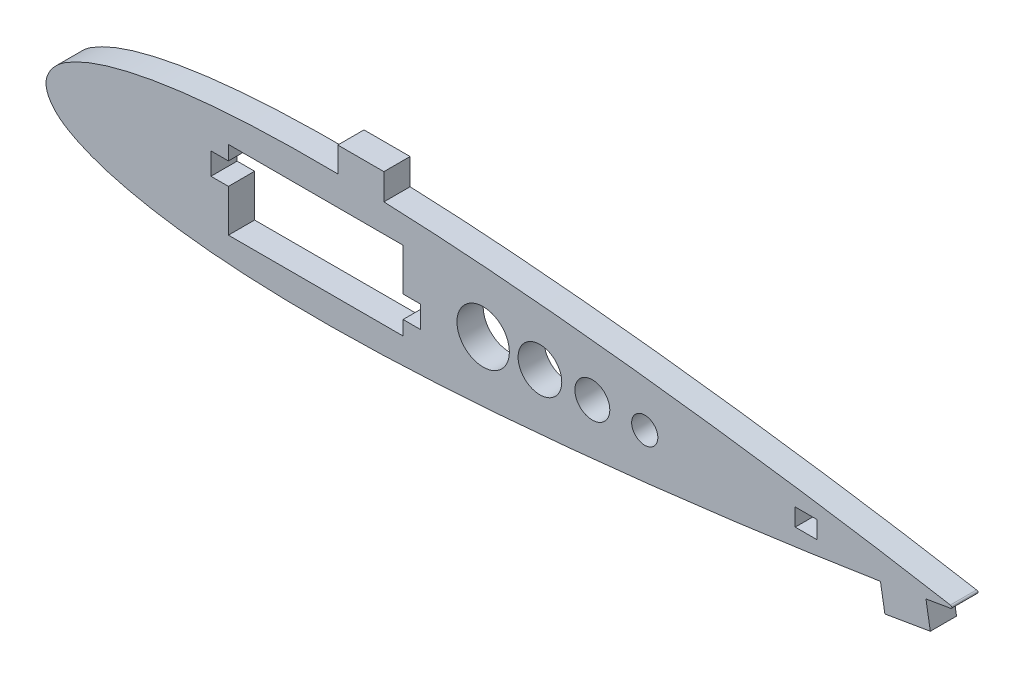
ISO-10303-21;
HEADER;
FILE_DESCRIPTION(('STEP AP214'),'2;1');
FILE_NAME('part.step','',(''),(''),'','','');
FILE_SCHEMA(('AUTOMOTIVE_DESIGN { 1 0 10303 214 1 1 1 1 }'));
ENDSEC;
DATA;
#1=APPLICATION_CONTEXT('core data for automotive mechanical design processes');
#2=APPLICATION_PROTOCOL_DEFINITION('international standard','automotive_design',2000,#1);
#3=PRODUCT_CONTEXT('',#1,'mechanical');
#4=PRODUCT('Part','Part','',(#3));
#5=PRODUCT_RELATED_PRODUCT_CATEGORY('part','',(#4));
#6=PRODUCT_DEFINITION_FORMATION('','',#4);
#7=PRODUCT_DEFINITION_CONTEXT('part definition',#1,'design');
#8=PRODUCT_DEFINITION('design','',#6,#7);
#9=PRODUCT_DEFINITION_SHAPE('','',#8);
#10=(LENGTH_UNIT() NAMED_UNIT(*) SI_UNIT(.MILLI.,.METRE.));
#11=(NAMED_UNIT(*) PLANE_ANGLE_UNIT() SI_UNIT($,.RADIAN.));
#12=(NAMED_UNIT(*) SI_UNIT($,.STERADIAN.) SOLID_ANGLE_UNIT());
#13=UNCERTAINTY_MEASURE_WITH_UNIT(LENGTH_MEASURE(1.E-05),#10,'distance_accuracy_value','');
#14=(GEOMETRIC_REPRESENTATION_CONTEXT(3) GLOBAL_UNCERTAINTY_ASSIGNED_CONTEXT((#13)) GLOBAL_UNIT_ASSIGNED_CONTEXT((#10,
#11,#12)) REPRESENTATION_CONTEXT('',''));
#15=CARTESIAN_POINT('',(0.,0.,0.));
#16=DIRECTION('',(0.,0.,1.));
#17=DIRECTION('',(1.,0.,0.));
#18=AXIS2_PLACEMENT_3D('',#15,#16,#17);
#19=CARTESIAN_POINT('',(100.000000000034,0.158000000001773,3.));
#20=CARTESIAN_POINT('',(98.2752033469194,0.45697951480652,3.));
#21=CARTESIAN_POINT('',(94.8282706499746,1.05447734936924,3.));
#22=CARTESIAN_POINT('',(87.930256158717,2.16588767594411,3.));
#23=CARTESIAN_POINT('',(79.30695073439,3.44267804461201,3.));
#24=CARTESIAN_POINT('',(68.9533281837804,4.80441995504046,3.));
#25=CARTESIAN_POINT('',(58.6004831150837,5.9873769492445,3.));
#26=CARTESIAN_POINT('',(48.2472554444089,6.95662593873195,3.));
#27=CARTESIAN_POINT('',(40.4253928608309,7.47959973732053,3.));
#28=CARTESIAN_POINT('',(36.056405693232,7.66684029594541,3.));
#29=CARTESIAN_POINT('',(35.1430318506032,7.70085583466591,3.));
#30=B_SPLINE_CURVE_WITH_KNOTS('',3,(#19,#20,#21,#22,#23,#24,#25,#26,#27,#28,#29),.UNSPECIFIED.,
.F.,.F.,(4,1,1,1,1,1,1,1,4),(0.,0.0246840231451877,0.0493299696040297,0.0985220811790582,
0.147602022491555,0.19657827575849,0.245450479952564,0.294218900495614,0.307105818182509),.UNSPECIFIED.);
#31=DIRECTION('',(0.,0.,-1.));
#32=VECTOR('',#31,1.);
#33=SURFACE_OF_LINEAR_EXTRUSION('',#30,#32);
#34=CARTESIAN_POINT('',(100.000000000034,0.158000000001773,0.));
#35=CARTESIAN_POINT('',(98.2752033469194,0.45697951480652,0.));
#36=CARTESIAN_POINT('',(94.8282706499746,1.05447734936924,0.));
#37=CARTESIAN_POINT('',(87.930256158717,2.16588767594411,0.));
#38=CARTESIAN_POINT('',(79.30695073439,3.44267804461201,0.));
#39=CARTESIAN_POINT('',(68.9533281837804,4.80441995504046,0.));
#40=CARTESIAN_POINT('',(58.6004831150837,5.9873769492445,0.));
#41=CARTESIAN_POINT('',(48.2472554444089,6.95662593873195,0.));
#42=CARTESIAN_POINT('',(40.4253928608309,7.47959973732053,0.));
#43=CARTESIAN_POINT('',(36.056405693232,7.66684029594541,0.));
#44=CARTESIAN_POINT('',(35.1430318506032,7.70085583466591,0.));
#45=B_SPLINE_CURVE_WITH_KNOTS('',3,(#34,#35,#36,#37,#38,#39,#40,#41,#42,#43,#44),.UNSPECIFIED.,
.F.,.F.,(4,1,1,1,1,1,1,1,4),(0.,0.0246840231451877,0.0493299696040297,0.0985220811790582,
0.147602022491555,0.19657827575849,0.245450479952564,0.294218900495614,0.307105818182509),.UNSPECIFIED.);
#46=CARTESIAN_POINT('',(100.000000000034,0.158000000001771,0.));
#47=VERTEX_POINT('',#46);
#48=CARTESIAN_POINT('',(35.1430318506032,7.70085583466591,0.));
#49=VERTEX_POINT('',#48);
#50=EDGE_CURVE('E333',#47,#49,#45,.T.);
#51=ORIENTED_EDGE('',*,*,#50,.T.);
#52=DIRECTION('',(0.,0.,-1.));
#53=VECTOR('',#52,1.);
#54=CARTESIAN_POINT('',(35.1430318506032,7.70085583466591,3.));
#55=LINE('',#54,#53);
#56=CARTESIAN_POINT('',(35.1430318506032,7.70085583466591,3.));
#57=VERTEX_POINT('',#56);
#58=EDGE_CURVE('E327',#57,#49,#55,.T.);
#59=ORIENTED_EDGE('',*,*,#58,.F.);
#60=CARTESIAN_POINT('',(100.000000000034,0.158000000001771,3.));
#61=VERTEX_POINT('',#60);
#62=EDGE_CURVE('E272',#61,#57,#30,.T.);
#63=ORIENTED_EDGE('',*,*,#62,.F.);
#64=DIRECTION('',(0.,0.,-1.));
#65=VECTOR('',#64,1.);
#66=CARTESIAN_POINT('',(100.000000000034,0.158000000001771,3.));
#67=LINE('',#66,#65);
#68=EDGE_CURVE('E368',#61,#47,#67,.T.);
#69=ORIENTED_EDGE('',*,*,#68,.T.);
#70=EDGE_LOOP('',(#51,#59,#63,#69));
#71=FACE_BOUND('',#70,.T.);
#72=ADVANCED_FACE('F40',(#71),#33,.F.);
#73=CARTESIAN_POINT('',(35.1430318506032,10.7008558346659,3.));
#74=DIRECTION('',(-1.,0.,0.));
#75=DIRECTION('',(0.,0.,1.));
#76=AXIS2_PLACEMENT_3D('',#73,#74,#75);
#77=PLANE('',#76);
#78=DIRECTION('',(0.,1.,0.));
#79=VECTOR('',#78,1.);
#80=CARTESIAN_POINT('',(35.1430318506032,10.7008558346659,0.));
#81=LINE('',#80,#79);
#82=CARTESIAN_POINT('',(35.1430318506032,10.7008558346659,0.));
#83=VERTEX_POINT('',#82);
#84=EDGE_CURVE('E322',#49,#83,#81,.T.);
#85=ORIENTED_EDGE('',*,*,#84,.T.);
#86=DIRECTION('',(0.,0.,-1.));
#87=VECTOR('',#86,1.);
#88=CARTESIAN_POINT('',(35.1430318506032,10.7008558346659,3.));
#89=LINE('',#88,#87);
#90=CARTESIAN_POINT('',(35.1430318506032,10.7008558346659,3.));
#91=VERTEX_POINT('',#90);
#92=EDGE_CURVE('E324',#91,#83,#89,.T.);
#93=ORIENTED_EDGE('',*,*,#92,.F.);
#94=DIRECTION('',(0.,1.,0.));
#95=VECTOR('',#94,1.);
#96=CARTESIAN_POINT('',(35.1430318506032,10.7008558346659,3.));
#97=LINE('',#96,#95);
#98=EDGE_CURVE('E278',#57,#91,#97,.T.);
#99=ORIENTED_EDGE('',*,*,#98,.F.);
#100=ORIENTED_EDGE('',*,*,#58,.T.);
#101=EDGE_LOOP('',(#85,#93,#99,#100));
#102=FACE_BOUND('',#101,.T.);
#103=ADVANCED_FACE('F312',(#102),#77,.F.);
#104=CARTESIAN_POINT('',(29.8630318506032,10.7008558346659,3.));
#105=DIRECTION('',(0.,-1.,0.));
#106=DIRECTION('',(0.,0.,-1.));
#107=AXIS2_PLACEMENT_3D('',#104,#105,#106);
#108=PLANE('',#107);
#109=DIRECTION('',(-1.,0.,0.));
#110=VECTOR('',#109,1.);
#111=CARTESIAN_POINT('',(29.8630318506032,10.7008558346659,0.));
#112=LINE('',#111,#110);
#113=CARTESIAN_POINT('',(29.8630318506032,10.7008558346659,0.));
#114=VERTEX_POINT('',#113);
#115=EDGE_CURVE('E332',#83,#114,#112,.T.);
#116=ORIENTED_EDGE('',*,*,#115,.T.);
#117=DIRECTION('',(0.,0.,-1.));
#118=VECTOR('',#117,1.);
#119=CARTESIAN_POINT('',(29.8630318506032,10.7008558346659,3.));
#120=LINE('',#119,#118);
#121=CARTESIAN_POINT('',(29.8630318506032,10.7008558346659,3.));
#122=VERTEX_POINT('',#121);
#123=EDGE_CURVE('E337',#122,#114,#120,.T.);
#124=ORIENTED_EDGE('',*,*,#123,.F.);
#125=DIRECTION('',(-1.,0.,0.));
#126=VECTOR('',#125,1.);
#127=CARTESIAN_POINT('',(29.8630318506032,10.7008558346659,3.));
#128=LINE('',#127,#126);
#129=EDGE_CURVE('E284',#91,#122,#128,.T.);
#130=ORIENTED_EDGE('',*,*,#129,.F.);
#131=ORIENTED_EDGE('',*,*,#92,.T.);
#132=EDGE_LOOP('',(#116,#124,#130,#131));
#133=FACE_BOUND('',#132,.T.);
#134=ADVANCED_FACE('F309',(#133),#108,.F.);
#135=CARTESIAN_POINT('',(29.8630318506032,10.7008558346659,3.));
#136=DIRECTION('',(1.,0.,0.));
#137=DIRECTION('',(0.,0.,-1.));
#138=AXIS2_PLACEMENT_3D('',#135,#136,#137);
#139=PLANE('',#138);
#140=DIRECTION('',(0.,-1.,0.));
#141=VECTOR('',#140,1.);
#142=CARTESIAN_POINT('',(29.8630318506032,10.7008558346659,0.));
#143=LINE('',#142,#141);
#144=CARTESIAN_POINT('',(29.8630318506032,7.83645408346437,0.));
#145=VERTEX_POINT('',#144);
#146=EDGE_CURVE('E342',#114,#145,#143,.T.);
#147=ORIENTED_EDGE('',*,*,#146,.T.);
#148=DIRECTION('',(0.,0.,-1.));
#149=VECTOR('',#148,1.);
#150=CARTESIAN_POINT('',(29.8630318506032,7.83645408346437,3.));
#151=LINE('',#150,#149);
#152=CARTESIAN_POINT('',(29.8630318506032,7.83645408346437,3.));
#153=VERTEX_POINT('',#152);
#154=EDGE_CURVE('E387',#153,#145,#151,.T.);
#155=ORIENTED_EDGE('',*,*,#154,.F.);
#156=DIRECTION('',(0.,-1.,0.));
#157=VECTOR('',#156,1.);
#158=CARTESIAN_POINT('',(29.8630318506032,10.7008558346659,3.));
#159=LINE('',#158,#157);
#160=EDGE_CURVE('E286',#122,#153,#159,.T.);
#161=ORIENTED_EDGE('',*,*,#160,.F.);
#162=ORIENTED_EDGE('',*,*,#123,.T.);
#163=EDGE_LOOP('',(#147,#155,#161,#162));
#164=FACE_BOUND('',#163,.T.);
#165=ADVANCED_FACE('F304',(#164),#139,.F.);
#166=CARTESIAN_POINT('',(29.8630318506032,7.83645408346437,3.));
#167=CARTESIAN_POINT('',(29.0848548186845,7.8468641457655,3.));
#168=CARTESIAN_POINT('',(26.5806343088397,7.86591663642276,3.));
#169=CARTESIAN_POINT('',(22.3481860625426,7.81355100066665,3.));
#170=CARTESIAN_POINT('',(17.164843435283,7.56395909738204,3.));
#171=CARTESIAN_POINT('',(11.9741002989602,7.07764275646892,3.));
#172=CARTESIAN_POINT('',(7.65230652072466,6.39306089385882,3.));
#173=CARTESIAN_POINT('',(4.20045051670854,5.57690727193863,3.));
#174=CARTESIAN_POINT('',(1.57930972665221,4.75740436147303,3.));
#175=CARTESIAN_POINT('',(-0.624643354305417,3.76154949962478,3.));
#176=CARTESIAN_POINT('',(-2.60356179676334,2.44260726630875,3.));
#177=CARTESIAN_POINT('',(-4.14030493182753,0.125949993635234,3.));
#178=CARTESIAN_POINT('',(-2.60941952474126,-2.19458232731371,3.));
#179=CARTESIAN_POINT('',(-0.633839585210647,-3.51851990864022,3.));
#180=CARTESIAN_POINT('',(1.56759052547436,-4.51993967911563,3.));
#181=CARTESIAN_POINT('',(4.18665255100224,-5.34606204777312,3.));
#182=CARTESIAN_POINT('',(7.63643560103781,-6.17093386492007,3.));
#183=CARTESIAN_POINT('',(11.9564860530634,-6.86643216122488,3.));
#184=CARTESIAN_POINT('',(17.1459839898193,-7.36586089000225,3.));
#185=CARTESIAN_POINT('',(22.3286795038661,-7.62854723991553,3.));
#186=CARTESIAN_POINT('',(29.235442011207,-7.73145319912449,3.));
#187=CARTESIAN_POINT('',(37.8728960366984,-7.50324815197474,3.));
#188=CARTESIAN_POINT('',(48.2298311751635,-6.83705655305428,3.));
#189=CARTESIAN_POINT('',(58.5854745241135,-5.89396714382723,3.));
#190=CARTESIAN_POINT('',(68.9412751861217,-4.73716944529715,3.));
#191=CARTESIAN_POINT('',(79.2983050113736,-3.40158936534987,3.));
#192=CARTESIAN_POINT('',(86.9807260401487,-2.2839360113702,3.));
#193=CARTESIAN_POINT('',(91.2118653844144,-1.62324988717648,3.));
#194=CARTESIAN_POINT('',(91.9959112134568,-1.49899002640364,3.));
#195=B_SPLINE_CURVE_WITH_KNOTS('',3,(#166,#167,#168,#169,#170,#171,#172,#173,#174,#175,#176,
#177,#178,#179,#180,#181,#182,#183,#184,#185,#186,#187,#188,#189,#190,#191,#192,#193,#194),
.UNSPECIFIED.,.F.,.F.,(4,1,1,1,1,1,1,1,1,1,1,1,1,1,1,1,1,1,1,1,1,1,1,1,1,1,4),
(0.331930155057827,0.342903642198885,0.367241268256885,0.391607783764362,0.416059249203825,
0.440726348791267,0.453242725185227,0.466028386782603,0.479472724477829,0.486972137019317,0.5,
0.513027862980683,0.520527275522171,0.533971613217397,0.546757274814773,0.559273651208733,
0.583940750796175,0.608392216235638,0.632758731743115,0.657096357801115,0.705781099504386,
0.754549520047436,0.803421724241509,0.852397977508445,0.901477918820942,0.95067003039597,
0.961863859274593),.UNSPECIFIED.);
#196=DIRECTION('',(0.,0.,-1.));
#197=VECTOR('',#196,1.);
#198=SURFACE_OF_LINEAR_EXTRUSION('',#195,#197);
#199=CARTESIAN_POINT('',(29.8630318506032,7.83645408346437,0.));
#200=CARTESIAN_POINT('',(29.0848548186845,7.8468641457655,0.));
#201=CARTESIAN_POINT('',(26.5806343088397,7.86591663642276,0.));
#202=CARTESIAN_POINT('',(22.3481860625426,7.81355100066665,0.));
#203=CARTESIAN_POINT('',(17.164843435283,7.56395909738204,0.));
#204=CARTESIAN_POINT('',(11.9741002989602,7.07764275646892,0.));
#205=CARTESIAN_POINT('',(7.65230652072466,6.39306089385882,0.));
#206=CARTESIAN_POINT('',(4.20045051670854,5.57690727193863,0.));
#207=CARTESIAN_POINT('',(1.57930972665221,4.75740436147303,0.));
#208=CARTESIAN_POINT('',(-0.624643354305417,3.76154949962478,0.));
#209=CARTESIAN_POINT('',(-2.60356179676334,2.44260726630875,0.));
#210=CARTESIAN_POINT('',(-4.14030493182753,0.125949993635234,0.));
#211=CARTESIAN_POINT('',(-2.60941952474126,-2.19458232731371,0.));
#212=CARTESIAN_POINT('',(-0.633839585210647,-3.51851990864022,0.));
#213=CARTESIAN_POINT('',(1.56759052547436,-4.51993967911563,0.));
#214=CARTESIAN_POINT('',(4.18665255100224,-5.34606204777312,0.));
#215=CARTESIAN_POINT('',(7.63643560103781,-6.17093386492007,0.));
#216=CARTESIAN_POINT('',(11.9564860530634,-6.86643216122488,0.));
#217=CARTESIAN_POINT('',(17.1459839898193,-7.36586089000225,0.));
#218=CARTESIAN_POINT('',(22.3286795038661,-7.62854723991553,0.));
#219=CARTESIAN_POINT('',(29.235442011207,-7.73145319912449,0.));
#220=CARTESIAN_POINT('',(37.8728960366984,-7.50324815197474,0.));
#221=CARTESIAN_POINT('',(48.2298311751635,-6.83705655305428,0.));
#222=CARTESIAN_POINT('',(58.5854745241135,-5.89396714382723,0.));
#223=CARTESIAN_POINT('',(68.9412751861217,-4.73716944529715,0.));
#224=CARTESIAN_POINT('',(79.2983050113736,-3.40158936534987,0.));
#225=CARTESIAN_POINT('',(86.9807260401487,-2.2839360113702,0.));
#226=CARTESIAN_POINT('',(91.2118653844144,-1.62324988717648,0.));
#227=CARTESIAN_POINT('',(91.9959112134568,-1.49899002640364,0.));
#228=B_SPLINE_CURVE_WITH_KNOTS('',3,(#199,#200,#201,#202,#203,#204,#205,#206,#207,#208,#209,
#210,#211,#212,#213,#214,#215,#216,#217,#218,#219,#220,#221,#222,#223,#224,#225,#226,#227),
.UNSPECIFIED.,.F.,.F.,(4,1,1,1,1,1,1,1,1,1,1,1,1,1,1,1,1,1,1,1,1,1,1,1,1,1,4),
(0.331930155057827,0.342903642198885,0.367241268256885,0.391607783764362,0.416059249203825,
0.440726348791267,0.453242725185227,0.466028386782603,0.479472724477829,0.486972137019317,0.5,
0.513027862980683,0.520527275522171,0.533971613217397,0.546757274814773,0.559273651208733,
0.583940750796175,0.608392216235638,0.632758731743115,0.657096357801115,0.705781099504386,
0.754549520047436,0.803421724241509,0.852397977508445,0.901477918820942,0.95067003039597,
0.961863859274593),.UNSPECIFIED.);
#229=CARTESIAN_POINT('',(91.9959112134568,-1.49899002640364,0.));
#230=VERTEX_POINT('',#229);
#231=EDGE_CURVE('E344',#145,#230,#228,.T.);
#232=ORIENTED_EDGE('',*,*,#231,.T.);
#233=DIRECTION('',(0.,0.,-1.));
#234=VECTOR('',#233,1.);
#235=CARTESIAN_POINT('',(91.9959112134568,-1.49899002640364,3.));
#236=LINE('',#235,#234);
#237=CARTESIAN_POINT('',(91.9959112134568,-1.49899002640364,3.));
#238=VERTEX_POINT('',#237);
#239=EDGE_CURVE('E384',#238,#230,#236,.T.);
#240=ORIENTED_EDGE('',*,*,#239,.F.);
#241=EDGE_CURVE('E288',#153,#238,#195,.T.);
#242=ORIENTED_EDGE('',*,*,#241,.F.);
#243=ORIENTED_EDGE('',*,*,#154,.T.);
#244=EDGE_LOOP('',(#232,#240,#242,#243));
#245=FACE_BOUND('',#244,.T.);
#246=ADVANCED_FACE('F299',(#245),#198,.F.);
#247=CARTESIAN_POINT('',(91.9959112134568,-1.49899002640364,3.));
#248=DIRECTION('',(0.985835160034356,0.167717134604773,0.));
#249=DIRECTION('',(-0.167717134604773,0.985835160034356,0.));
#250=AXIS2_PLACEMENT_3D('',#247,#248,#249);
#251=PLANE('',#250);
#252=DIRECTION('',(0.167717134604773,-0.985835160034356,0.));
#253=VECTOR('',#252,1.);
#254=CARTESIAN_POINT('',(91.9959112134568,-1.49899002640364,0.));
#255=LINE('',#254,#253);
#256=CARTESIAN_POINT('',(92.5030783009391,-4.48009954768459,0.));
#257=VERTEX_POINT('',#256);
#258=EDGE_CURVE('E351',#230,#257,#255,.T.);
#259=ORIENTED_EDGE('',*,*,#258,.T.);
#260=DIRECTION('',(0.,0.,-1.));
#261=VECTOR('',#260,1.);
#262=CARTESIAN_POINT('',(92.5030783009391,-4.48009954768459,3.));
#263=LINE('',#262,#261);
#264=CARTESIAN_POINT('',(92.5030783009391,-4.48009954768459,3.));
#265=VERTEX_POINT('',#264);
#266=EDGE_CURVE('E381',#265,#257,#263,.T.);
#267=ORIENTED_EDGE('',*,*,#266,.F.);
#268=DIRECTION('',(0.167717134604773,-0.985835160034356,0.));
#269=VECTOR('',#268,1.);
#270=CARTESIAN_POINT('',(91.9959112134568,-1.49899002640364,3.));
#271=LINE('',#270,#269);
#272=EDGE_CURVE('E293',#238,#265,#271,.T.);
#273=ORIENTED_EDGE('',*,*,#272,.F.);
#274=ORIENTED_EDGE('',*,*,#239,.T.);
#275=EDGE_LOOP('',(#259,#267,#273,#274));
#276=FACE_BOUND('',#275,.T.);
#277=ADVANCED_FACE('F303',(#276),#251,.F.);
#278=CARTESIAN_POINT('',(92.5030783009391,-4.48009954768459,3.));
#279=DIRECTION('',(-0.167717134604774,0.985835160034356,0.));
#280=DIRECTION('',(-0.985835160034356,-0.167717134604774,0.));
#281=AXIS2_PLACEMENT_3D('',#278,#279,#280);
#282=PLANE('',#281);
#283=DIRECTION('',(0.985835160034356,0.167717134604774,0.));
#284=VECTOR('',#283,1.);
#285=CARTESIAN_POINT('',(92.5030783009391,-4.48009954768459,0.));
#286=LINE('',#285,#284);
#287=CARTESIAN_POINT('',(97.7082879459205,-3.59455307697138,0.));
#288=VERTEX_POINT('',#287);
#289=EDGE_CURVE('E356',#257,#288,#286,.T.);
#290=ORIENTED_EDGE('',*,*,#289,.T.);
#291=DIRECTION('',(0.,0.,-1.));
#292=VECTOR('',#291,1.);
#293=CARTESIAN_POINT('',(97.7082879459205,-3.59455307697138,3.));
#294=LINE('',#293,#292);
#295=CARTESIAN_POINT('',(97.7082879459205,-3.59455307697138,3.));
#296=VERTEX_POINT('',#295);
#297=EDGE_CURVE('E378',#296,#288,#294,.T.);
#298=ORIENTED_EDGE('',*,*,#297,.F.);
#299=DIRECTION('',(0.985835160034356,0.167717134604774,0.));
#300=VECTOR('',#299,1.);
#301=CARTESIAN_POINT('',(92.5030783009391,-4.48009954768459,3.));
#302=LINE('',#301,#300);
#303=EDGE_CURVE('E575',#265,#296,#302,.T.);
#304=ORIENTED_EDGE('',*,*,#303,.F.);
#305=ORIENTED_EDGE('',*,*,#266,.T.);
#306=EDGE_LOOP('',(#290,#298,#304,#305));
#307=FACE_BOUND('',#306,.T.);
#308=ADVANCED_FACE('F572',(#307),#282,.F.);
#309=CARTESIAN_POINT('',(97.7082879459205,-3.59455307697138,3.));
#310=DIRECTION('',(-0.985835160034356,-0.167717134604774,0.));
#311=DIRECTION('',(0.167717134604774,-0.985835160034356,0.));
#312=AXIS2_PLACEMENT_3D('',#309,#310,#311);
#313=PLANE('',#312);
#314=DIRECTION('',(-0.167717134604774,0.985835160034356,0.));
#315=VECTOR('',#314,1.);
#316=CARTESIAN_POINT('',(97.7082879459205,-3.59455307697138,0.));
#317=LINE('',#316,#315);
#318=CARTESIAN_POINT('',(97.2051365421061,-0.637047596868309,0.));
#319=VERTEX_POINT('',#318);
#320=EDGE_CURVE('E358',#288,#319,#317,.T.);
#321=ORIENTED_EDGE('',*,*,#320,.T.);
#322=DIRECTION('',(0.,0.,-1.));
#323=VECTOR('',#322,1.);
#324=CARTESIAN_POINT('',(97.2051365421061,-0.637047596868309,3.));
#325=LINE('',#324,#323);
#326=CARTESIAN_POINT('',(97.2051365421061,-0.637047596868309,3.));
#327=VERTEX_POINT('',#326);
#328=EDGE_CURVE('E375',#327,#319,#325,.T.);
#329=ORIENTED_EDGE('',*,*,#328,.F.);
#330=DIRECTION('',(-0.167717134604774,0.985835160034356,0.));
#331=VECTOR('',#330,1.);
#332=CARTESIAN_POINT('',(97.7082879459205,-3.59455307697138,3.));
#333=LINE('',#332,#331);
#334=EDGE_CURVE('E548',#296,#327,#333,.T.);
#335=ORIENTED_EDGE('',*,*,#334,.F.);
#336=ORIENTED_EDGE('',*,*,#297,.T.);
#337=EDGE_LOOP('',(#321,#329,#335,#336));
#338=FACE_BOUND('',#337,.T.);
#339=ADVANCED_FACE('F540',(#338),#313,.F.);
#340=CARTESIAN_POINT('',(97.2051365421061,-0.637047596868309,3.));
#341=CARTESIAN_POINT('',(98.1369506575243,-0.478520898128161,3.));
#342=CARTESIAN_POINT('',(99.0684753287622,-0.318260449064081,3.));
#343=CARTESIAN_POINT('',(100.,-0.158,3.));
#344=B_SPLINE_CURVE_WITH_KNOTS('',3,(#340,#341,#342,#343),.UNSPECIFIED.,.F.,.F.,(4,4),
(0.986199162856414,1.),.UNSPECIFIED.);
#345=DIRECTION('',(0.,0.,-1.));
#346=VECTOR('',#345,1.);
#347=SURFACE_OF_LINEAR_EXTRUSION('',#344,#346);
#348=CARTESIAN_POINT('',(97.2051365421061,-0.637047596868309,0.));
#349=CARTESIAN_POINT('',(98.1369506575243,-0.478520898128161,0.));
#350=CARTESIAN_POINT('',(99.0684753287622,-0.318260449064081,0.));
#351=CARTESIAN_POINT('',(100.,-0.158,0.));
#352=B_SPLINE_CURVE_WITH_KNOTS('',3,(#348,#349,#350,#351),.UNSPECIFIED.,.F.,.F.,(4,4),
(0.986199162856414,1.),.UNSPECIFIED.);
#353=CARTESIAN_POINT('',(100.,-0.158000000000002,0.));
#354=VERTEX_POINT('',#353);
#355=EDGE_CURVE('E360',#319,#354,#352,.T.);
#356=ORIENTED_EDGE('',*,*,#355,.T.);
#357=DIRECTION('',(0.,0.,-1.));
#358=VECTOR('',#357,1.);
#359=CARTESIAN_POINT('',(100.,-0.158000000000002,3.));
#360=LINE('',#359,#358);
#361=CARTESIAN_POINT('',(100.,-0.158000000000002,3.));
#362=VERTEX_POINT('',#361);
#363=EDGE_CURVE('E371',#362,#354,#360,.T.);
#364=ORIENTED_EDGE('',*,*,#363,.F.);
#365=EDGE_CURVE('E542',#327,#362,#344,.T.);
#366=ORIENTED_EDGE('',*,*,#365,.F.);
#367=ORIENTED_EDGE('',*,*,#328,.T.);
#368=EDGE_LOOP('',(#356,#364,#366,#367));
#369=FACE_BOUND('',#368,.T.);
#370=ADVANCED_FACE('F535',(#369),#347,.F.);
#371=CARTESIAN_POINT('',(100.008153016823,0.,3.));
#372=DIRECTION('',(0.,0.,-1.));
#373=DIRECTION('',(-1.,0.,0.));
#374=AXIS2_PLACEMENT_3D('',#371,#372,#373);
#375=CYLINDRICAL_SURFACE('',#374,0.158210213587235);
#376=CARTESIAN_POINT('',(100.008153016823,0.,0.));
#377=DIRECTION('',(0.,0.,1.));
#378=DIRECTION('',(-1.,0.,0.));
#379=AXIS2_PLACEMENT_3D('',#376,#377,#378);
#380=CIRCLE('',#379,0.158210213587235);
#381=EDGE_CURVE('E279',#354,#47,#380,.T.);
#382=ORIENTED_EDGE('',*,*,#381,.T.);
#383=ORIENTED_EDGE('',*,*,#68,.F.);
#384=CARTESIAN_POINT('',(100.008153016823,0.,3.));
#385=DIRECTION('',(0.,0.,1.));
#386=DIRECTION('',(-1.,0.,0.));
#387=AXIS2_PLACEMENT_3D('',#384,#385,#386);
#388=CIRCLE('',#387,0.158210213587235);
#389=EDGE_CURVE('E372',#362,#61,#388,.T.);
#390=ORIENTED_EDGE('',*,*,#389,.F.);
#391=ORIENTED_EDGE('',*,*,#363,.T.);
#392=EDGE_LOOP('',(#382,#383,#390,#391));
#393=FACE_BOUND('',#392,.T.);
#394=ADVANCED_FACE('F452',(#393),#375,.T.);
#395=CARTESIAN_POINT('',(67.6856329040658,4.92908077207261,3.));
#396=DIRECTION('',(0.,0.,-1.));
#397=DIRECTION('',(-1.,0.,0.));
#398=AXIS2_PLACEMENT_3D('',#395,#396,#397);
#399=PLANE('',#398);
#400=DIRECTION('',(1.,0.,0.));
#401=VECTOR('',#400,1.);
#402=CARTESIAN_POINT('',(82.2396965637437,-1.,3.));
#403=LINE('',#402,#401);
#404=CARTESIAN_POINT('',(82.2396965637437,-1.,3.));
#405=VERTEX_POINT('',#404);
#406=CARTESIAN_POINT('',(84.7596965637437,-1.,3.));
#407=VERTEX_POINT('',#406);
#408=EDGE_CURVE('E266',#405,#407,#403,.T.);
#409=ORIENTED_EDGE('',*,*,#408,.F.);
#410=DIRECTION('',(0.,-1.,0.));
#411=VECTOR('',#410,1.);
#412=CARTESIAN_POINT('',(82.2396965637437,1.,3.));
#413=LINE('',#412,#411);
#414=CARTESIAN_POINT('',(82.2396965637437,1.,3.));
#415=VERTEX_POINT('',#414);
#416=EDGE_CURVE('E55',#415,#405,#413,.T.);
#417=ORIENTED_EDGE('',*,*,#416,.F.);
#418=DIRECTION('',(-1.,0.,0.));
#419=VECTOR('',#418,1.);
#420=CARTESIAN_POINT('',(82.2396965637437,1.,3.));
#421=LINE('',#420,#419);
#422=CARTESIAN_POINT('',(84.7596965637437,1.,3.));
#423=VERTEX_POINT('',#422);
#424=EDGE_CURVE('E254',#423,#415,#421,.T.);
#425=ORIENTED_EDGE('',*,*,#424,.F.);
#426=DIRECTION('',(0.,1.,0.));
#427=VECTOR('',#426,1.);
#428=CARTESIAN_POINT('',(84.7596965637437,1.,3.));
#429=LINE('',#428,#427);
#430=EDGE_CURVE('E263',#407,#423,#429,.T.);
#431=ORIENTED_EDGE('',*,*,#430,.F.);
#432=EDGE_LOOP('',(#409,#417,#425,#431));
#433=FACE_BOUND('',#432,.T.);
#434=CARTESIAN_POINT('',(53.0081530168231,0.,3.));
#435=DIRECTION('',(0.,0.,1.));
#436=DIRECTION('',(1.,0.,0.));
#437=AXIS2_PLACEMENT_3D('',#434,#435,#436);
#438=CIRCLE('',#437,2.5);
#439=CARTESIAN_POINT('',(55.5081530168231,0.,3.));
#440=VERTEX_POINT('',#439);
#441=EDGE_CURVE('E246',#440,#440,#438,.T.);
#442=ORIENTED_EDGE('',*,*,#441,.F.);
#443=EDGE_LOOP('',(#442));
#444=FACE_BOUND('',#443,.T.);
#445=CARTESIAN_POINT('',(59.0081530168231,0.,3.));
#446=DIRECTION('',(0.,0.,1.));
#447=DIRECTION('',(1.,0.,0.));
#448=AXIS2_PLACEMENT_3D('',#445,#446,#447);
#449=CIRCLE('',#448,2.);
#450=CARTESIAN_POINT('',(61.0081530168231,0.,3.));
#451=VERTEX_POINT('',#450);
#452=EDGE_CURVE('E240',#451,#451,#449,.T.);
#453=ORIENTED_EDGE('',*,*,#452,.F.);
#454=EDGE_LOOP('',(#453));
#455=FACE_BOUND('',#454,.T.);
#456=CARTESIAN_POINT('',(65.0081530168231,0.,3.));
#457=DIRECTION('',(0.,0.,1.));
#458=DIRECTION('',(1.,0.,0.));
#459=AXIS2_PLACEMENT_3D('',#456,#457,#458);
#460=CIRCLE('',#459,1.5);
#461=CARTESIAN_POINT('',(66.5081530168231,0.,3.));
#462=VERTEX_POINT('',#461);
#463=EDGE_CURVE('E237',#462,#462,#460,.T.);
#464=ORIENTED_EDGE('',*,*,#463,.F.);
#465=EDGE_LOOP('',(#464));
#466=FACE_BOUND('',#465,.T.);
#467=DIRECTION('',(-1.,0.,0.));
#468=VECTOR('',#467,1.);
#469=CARTESIAN_POINT('',(15.3414863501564,2.86,3.));
#470=LINE('',#469,#468);
#471=CARTESIAN_POINT('',(17.3414863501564,2.86,3.));
#472=VERTEX_POINT('',#471);
#473=CARTESIAN_POINT('',(15.3414863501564,2.86,3.));
#474=VERTEX_POINT('',#473);
#475=EDGE_CURVE('E236',#472,#474,#470,.T.);
#476=ORIENTED_EDGE('',*,*,#475,.F.);
#477=DIRECTION('',(0.,-1.,0.));
#478=VECTOR('',#477,1.);
#479=CARTESIAN_POINT('',(17.3414863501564,4.5,3.));
#480=LINE('',#479,#478);
#481=CARTESIAN_POINT('',(17.3414863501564,4.5,3.));
#482=VERTEX_POINT('',#481);
#483=EDGE_CURVE('E63',#482,#472,#480,.T.);
#484=ORIENTED_EDGE('',*,*,#483,.F.);
#485=DIRECTION('',(-1.,0.,0.));
#486=VECTOR('',#485,1.);
#487=CARTESIAN_POINT('',(17.3414863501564,4.5,3.));
#488=LINE('',#487,#486);
#489=CARTESIAN_POINT('',(37.3414863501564,4.5,3.));
#490=VERTEX_POINT('',#489);
#491=EDGE_CURVE('E222',#490,#482,#488,.T.);
#492=ORIENTED_EDGE('',*,*,#491,.F.);
#493=DIRECTION('',(0.,1.,0.));
#494=VECTOR('',#493,1.);
#495=CARTESIAN_POINT('',(37.3414863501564,4.5,3.));
#496=LINE('',#495,#494);
#497=CARTESIAN_POINT('',(37.3414863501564,-0.34,3.));
#498=VERTEX_POINT('',#497);
#499=EDGE_CURVE('E228',#498,#490,#496,.T.);
#500=ORIENTED_EDGE('',*,*,#499,.F.);
#501=DIRECTION('',(-1.,0.,0.));
#502=VECTOR('',#501,1.);
#503=CARTESIAN_POINT('',(37.3414863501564,-0.34,3.));
#504=LINE('',#503,#502);
#505=CARTESIAN_POINT('',(39.3414863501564,-0.34,3.));
#506=VERTEX_POINT('',#505);
#507=EDGE_CURVE('E861',#506,#498,#504,.T.);
#508=ORIENTED_EDGE('',*,*,#507,.F.);
#509=DIRECTION('',(0.,1.,0.));
#510=VECTOR('',#509,1.);
#511=CARTESIAN_POINT('',(39.3414863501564,-0.34,3.));
#512=LINE('',#511,#510);
#513=CARTESIAN_POINT('',(39.3414863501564,-2.86,3.));
#514=VERTEX_POINT('',#513);
#515=EDGE_CURVE('E864',#514,#506,#512,.T.);
#516=ORIENTED_EDGE('',*,*,#515,.F.);
#517=DIRECTION('',(1.,0.,0.));
#518=VECTOR('',#517,1.);
#519=CARTESIAN_POINT('',(37.3414863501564,-2.86,3.));
#520=LINE('',#519,#518);
#521=CARTESIAN_POINT('',(37.3414863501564,-2.86,3.));
#522=VERTEX_POINT('',#521);
#523=EDGE_CURVE('E867',#522,#514,#520,.T.);
#524=ORIENTED_EDGE('',*,*,#523,.F.);
#525=DIRECTION('',(0.,1.,0.));
#526=VECTOR('',#525,1.);
#527=CARTESIAN_POINT('',(37.3414863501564,-2.86,3.));
#528=LINE('',#527,#526);
#529=CARTESIAN_POINT('',(37.3414863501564,-4.5,3.));
#530=VERTEX_POINT('',#529);
#531=EDGE_CURVE('E870',#530,#522,#528,.T.);
#532=ORIENTED_EDGE('',*,*,#531,.F.);
#533=DIRECTION('',(1.,0.,0.));
#534=VECTOR('',#533,1.);
#535=CARTESIAN_POINT('',(17.3414863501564,-4.5,3.));
#536=LINE('',#535,#534);
#537=CARTESIAN_POINT('',(17.3414863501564,-4.5,3.));
#538=VERTEX_POINT('',#537);
#539=EDGE_CURVE('E873',#538,#530,#536,.T.);
#540=ORIENTED_EDGE('',*,*,#539,.F.);
#541=DIRECTION('',(0.,-1.,0.));
#542=VECTOR('',#541,1.);
#543=CARTESIAN_POINT('',(17.3414863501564,0.34,3.));
#544=LINE('',#543,#542);
#545=CARTESIAN_POINT('',(17.3414863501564,0.34,3.));
#546=VERTEX_POINT('',#545);
#547=EDGE_CURVE('E876',#546,#538,#544,.T.);
#548=ORIENTED_EDGE('',*,*,#547,.F.);
#549=DIRECTION('',(1.,0.,0.));
#550=VECTOR('',#549,1.);
#551=CARTESIAN_POINT('',(15.3414863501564,0.34,3.));
#552=LINE('',#551,#550);
#553=CARTESIAN_POINT('',(15.3414863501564,0.34,3.));
#554=VERTEX_POINT('',#553);
#555=EDGE_CURVE('E879',#554,#546,#552,.T.);
#556=ORIENTED_EDGE('',*,*,#555,.F.);
#557=DIRECTION('',(0.,-1.,0.));
#558=VECTOR('',#557,1.);
#559=CARTESIAN_POINT('',(15.3414863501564,2.86,3.));
#560=LINE('',#559,#558);
#561=EDGE_CURVE('E242',#474,#554,#560,.T.);
#562=ORIENTED_EDGE('',*,*,#561,.F.);
#563=EDGE_LOOP('',(#476,#484,#492,#500,#508,#516,#524,#532,#540,#548,#556,#562));
#564=FACE_BOUND('',#563,.T.);
#565=CARTESIAN_POINT('',(46.5081530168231,0.,3.));
#566=DIRECTION('',(0.,0.,1.));
#567=DIRECTION('',(1.,0.,0.));
#568=AXIS2_PLACEMENT_3D('',#565,#566,#567);
#569=CIRCLE('',#568,3.);
#570=CARTESIAN_POINT('',(49.5081530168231,0.,3.));
#571=VERTEX_POINT('',#570);
#572=EDGE_CURVE('E249',#571,#571,#569,.T.);
#573=ORIENTED_EDGE('',*,*,#572,.F.);
#574=EDGE_LOOP('',(#573));
#575=FACE_BOUND('',#574,.T.);
#576=ORIENTED_EDGE('',*,*,#62,.T.);
#577=ORIENTED_EDGE('',*,*,#98,.T.);
#578=ORIENTED_EDGE('',*,*,#129,.T.);
#579=ORIENTED_EDGE('',*,*,#160,.T.);
#580=ORIENTED_EDGE('',*,*,#241,.T.);
#581=ORIENTED_EDGE('',*,*,#272,.T.);
#582=ORIENTED_EDGE('',*,*,#303,.T.);
#583=ORIENTED_EDGE('',*,*,#334,.T.);
#584=ORIENTED_EDGE('',*,*,#365,.T.);
#585=ORIENTED_EDGE('',*,*,#389,.T.);
#586=EDGE_LOOP('',(#576,#577,#578,#579,#580,#581,#582,#583,#584,#585));
#587=FACE_BOUND('',#586,.T.);
#588=ADVANCED_FACE('F232',(#433,#444,#455,#466,#564,#575,#587),#399,.F.);
#589=CARTESIAN_POINT('',(67.6856329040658,4.92908077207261,0.));
#590=DIRECTION('',(0.,0.,-1.));
#591=DIRECTION('',(-1.,0.,0.));
#592=AXIS2_PLACEMENT_3D('',#589,#590,#591);
#593=PLANE('',#592);
#594=DIRECTION('',(0.,1.,0.));
#595=VECTOR('',#594,1.);
#596=CARTESIAN_POINT('',(82.2396965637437,4.92908077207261,0.));
#597=LINE('',#596,#595);
#598=CARTESIAN_POINT('',(82.2396965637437,-1.,0.));
#599=VERTEX_POINT('',#598);
#600=CARTESIAN_POINT('',(82.2396965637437,1.,0.));
#601=VERTEX_POINT('',#600);
#602=EDGE_CURVE('E11',#599,#601,#597,.T.);
#603=ORIENTED_EDGE('',*,*,#602,.F.);
#604=DIRECTION('',(-1.,0.,0.));
#605=VECTOR('',#604,1.);
#606=CARTESIAN_POINT('',(67.6856329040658,-1.,0.));
#607=LINE('',#606,#605);
#608=CARTESIAN_POINT('',(84.7596965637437,-0.999999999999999,0.));
#609=VERTEX_POINT('',#608);
#610=EDGE_CURVE('E419',#609,#599,#607,.T.);
#611=ORIENTED_EDGE('',*,*,#610,.F.);
#612=DIRECTION('',(0.,-1.,0.));
#613=VECTOR('',#612,1.);
#614=CARTESIAN_POINT('',(84.7596965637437,4.92908077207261,0.));
#615=LINE('',#614,#613);
#616=CARTESIAN_POINT('',(84.7596965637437,1.,0.));
#617=VERTEX_POINT('',#616);
#618=EDGE_CURVE('E429',#617,#609,#615,.T.);
#619=ORIENTED_EDGE('',*,*,#618,.F.);
#620=DIRECTION('',(1.,0.,0.));
#621=VECTOR('',#620,1.);
#622=CARTESIAN_POINT('',(67.6856329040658,0.999999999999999,0.));
#623=LINE('',#622,#621);
#624=EDGE_CURVE('E48',#601,#617,#623,.T.);
#625=ORIENTED_EDGE('',*,*,#624,.F.);
#626=EDGE_LOOP('',(#603,#611,#619,#625));
#627=FACE_BOUND('',#626,.T.);
#628=CARTESIAN_POINT('',(53.0081530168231,0.,0.));
#629=DIRECTION('',(0.,0.,-1.));
#630=DIRECTION('',(-1.,0.,0.));
#631=AXIS2_PLACEMENT_3D('',#628,#629,#630);
#632=CIRCLE('',#631,2.5);
#633=CARTESIAN_POINT('',(50.5081530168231,0.,0.));
#634=VERTEX_POINT('',#633);
#635=EDGE_CURVE('E425',#634,#634,#632,.T.);
#636=ORIENTED_EDGE('',*,*,#635,.F.);
#637=EDGE_LOOP('',(#636));
#638=FACE_BOUND('',#637,.T.);
#639=CARTESIAN_POINT('',(59.0081530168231,0.,0.));
#640=DIRECTION('',(0.,0.,-1.));
#641=DIRECTION('',(-1.,0.,0.));
#642=AXIS2_PLACEMENT_3D('',#639,#640,#641);
#643=CIRCLE('',#642,2.);
#644=CARTESIAN_POINT('',(57.0081530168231,0.,0.));
#645=VERTEX_POINT('',#644);
#646=EDGE_CURVE('E422',#645,#645,#643,.T.);
#647=ORIENTED_EDGE('',*,*,#646,.F.);
#648=EDGE_LOOP('',(#647));
#649=FACE_BOUND('',#648,.T.);
#650=CARTESIAN_POINT('',(65.0081530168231,0.,0.));
#651=DIRECTION('',(0.,0.,-1.));
#652=DIRECTION('',(-1.,0.,0.));
#653=AXIS2_PLACEMENT_3D('',#650,#651,#652);
#654=CIRCLE('',#653,1.5);
#655=CARTESIAN_POINT('',(63.5081530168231,0.,0.));
#656=VERTEX_POINT('',#655);
#657=EDGE_CURVE('E395',#656,#656,#654,.T.);
#658=ORIENTED_EDGE('',*,*,#657,.F.);
#659=EDGE_LOOP('',(#658));
#660=FACE_BOUND('',#659,.T.);
#661=DIRECTION('',(0.,1.,0.));
#662=VECTOR('',#661,1.);
#663=CARTESIAN_POINT('',(17.3414863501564,4.92908077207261,0.));
#664=LINE('',#663,#662);
#665=CARTESIAN_POINT('',(17.3414863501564,2.86,0.));
#666=VERTEX_POINT('',#665);
#667=CARTESIAN_POINT('',(17.3414863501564,4.5,0.));
#668=VERTEX_POINT('',#667);
#669=EDGE_CURVE('E216',#666,#668,#664,.T.);
#670=ORIENTED_EDGE('',*,*,#669,.F.);
#671=DIRECTION('',(1.,0.,0.));
#672=VECTOR('',#671,1.);
#673=CARTESIAN_POINT('',(67.6856329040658,2.86,0.));
#674=LINE('',#673,#672);
#675=CARTESIAN_POINT('',(15.3414863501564,2.86,0.));
#676=VERTEX_POINT('',#675);
#677=EDGE_CURVE('E392',#676,#666,#674,.T.);
#678=ORIENTED_EDGE('',*,*,#677,.F.);
#679=DIRECTION('',(0.,1.,0.));
#680=VECTOR('',#679,1.);
#681=CARTESIAN_POINT('',(15.3414863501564,4.92908077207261,0.));
#682=LINE('',#681,#680);
#683=CARTESIAN_POINT('',(15.3414863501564,0.34,0.));
#684=VERTEX_POINT('',#683);
#685=EDGE_CURVE('E397',#684,#676,#682,.T.);
#686=ORIENTED_EDGE('',*,*,#685,.F.);
#687=DIRECTION('',(-1.,0.,0.));
#688=VECTOR('',#687,1.);
#689=CARTESIAN_POINT('',(67.6856329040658,0.34,0.));
#690=LINE('',#689,#688);
#691=CARTESIAN_POINT('',(17.3414863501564,0.34,0.));
#692=VERTEX_POINT('',#691);
#693=EDGE_CURVE('E400',#692,#684,#690,.T.);
#694=ORIENTED_EDGE('',*,*,#693,.F.);
#695=DIRECTION('',(0.,1.,0.));
#696=VECTOR('',#695,1.);
#697=CARTESIAN_POINT('',(17.3414863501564,4.92908077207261,0.));
#698=LINE('',#697,#696);
#699=CARTESIAN_POINT('',(17.3414863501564,-4.5,0.));
#700=VERTEX_POINT('',#699);
#701=EDGE_CURVE('E402',#700,#692,#698,.T.);
#702=ORIENTED_EDGE('',*,*,#701,.F.);
#703=DIRECTION('',(-1.,0.,0.));
#704=VECTOR('',#703,1.);
#705=CARTESIAN_POINT('',(67.6856329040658,-4.49999999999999,0.));
#706=LINE('',#705,#704);
#707=CARTESIAN_POINT('',(37.3414863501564,-4.5,0.));
#708=VERTEX_POINT('',#707);
#709=EDGE_CURVE('E404',#708,#700,#706,.T.);
#710=ORIENTED_EDGE('',*,*,#709,.F.);
#711=DIRECTION('',(0.,-1.,0.));
#712=VECTOR('',#711,1.);
#713=CARTESIAN_POINT('',(37.3414863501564,4.92908077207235,0.));
#714=LINE('',#713,#712);
#715=CARTESIAN_POINT('',(37.3414863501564,-2.86,0.));
#716=VERTEX_POINT('',#715);
#717=EDGE_CURVE('E406',#716,#708,#714,.T.);
#718=ORIENTED_EDGE('',*,*,#717,.F.);
#719=DIRECTION('',(-1.,0.,0.));
#720=VECTOR('',#719,1.);
#721=CARTESIAN_POINT('',(67.6856329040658,-2.86,0.));
#722=LINE('',#721,#720);
#723=CARTESIAN_POINT('',(39.3414863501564,-2.86,0.));
#724=VERTEX_POINT('',#723);
#725=EDGE_CURVE('E408',#724,#716,#722,.T.);
#726=ORIENTED_EDGE('',*,*,#725,.F.);
#727=DIRECTION('',(0.,-1.,0.));
#728=VECTOR('',#727,1.);
#729=CARTESIAN_POINT('',(39.3414863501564,4.92908077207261,0.));
#730=LINE('',#729,#728);
#731=CARTESIAN_POINT('',(39.3414863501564,-0.34,0.));
#732=VERTEX_POINT('',#731);
#733=EDGE_CURVE('E410',#732,#724,#730,.T.);
#734=ORIENTED_EDGE('',*,*,#733,.F.);
#735=DIRECTION('',(1.,0.,0.));
#736=VECTOR('',#735,1.);
#737=CARTESIAN_POINT('',(67.6856329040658,-0.34,0.));
#738=LINE('',#737,#736);
#739=CARTESIAN_POINT('',(37.3414863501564,-0.34,0.));
#740=VERTEX_POINT('',#739);
#741=EDGE_CURVE('E412',#740,#732,#738,.T.);
#742=ORIENTED_EDGE('',*,*,#741,.F.);
#743=DIRECTION('',(0.,-1.,0.));
#744=VECTOR('',#743,1.);
#745=CARTESIAN_POINT('',(37.3414863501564,4.92908077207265,0.));
#746=LINE('',#745,#744);
#747=CARTESIAN_POINT('',(37.3414863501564,4.5,0.));
#748=VERTEX_POINT('',#747);
#749=EDGE_CURVE('E414',#748,#740,#746,.T.);
#750=ORIENTED_EDGE('',*,*,#749,.F.);
#751=DIRECTION('',(1.,0.,0.));
#752=VECTOR('',#751,1.);
#753=CARTESIAN_POINT('',(67.6856329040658,4.50000000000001,0.));
#754=LINE('',#753,#752);
#755=EDGE_CURVE('E416',#668,#748,#754,.T.);
#756=ORIENTED_EDGE('',*,*,#755,.F.);
#757=EDGE_LOOP('',(#670,#678,#686,#694,#702,#710,#718,#726,#734,#742,#750,#756));
#758=FACE_BOUND('',#757,.T.);
#759=CARTESIAN_POINT('',(46.5081530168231,0.,0.));
#760=DIRECTION('',(0.,0.,-1.));
#761=DIRECTION('',(-1.,0.,0.));
#762=AXIS2_PLACEMENT_3D('',#759,#760,#761);
#763=CIRCLE('',#762,3.);
#764=CARTESIAN_POINT('',(43.5081530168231,0.,0.));
#765=VERTEX_POINT('',#764);
#766=EDGE_CURVE('E271',#765,#765,#763,.T.);
#767=ORIENTED_EDGE('',*,*,#766,.F.);
#768=EDGE_LOOP('',(#767));
#769=FACE_BOUND('',#768,.T.);
#770=ORIENTED_EDGE('',*,*,#50,.F.);
#771=ORIENTED_EDGE('',*,*,#381,.F.);
#772=ORIENTED_EDGE('',*,*,#355,.F.);
#773=ORIENTED_EDGE('',*,*,#320,.F.);
#774=ORIENTED_EDGE('',*,*,#289,.F.);
#775=ORIENTED_EDGE('',*,*,#258,.F.);
#776=ORIENTED_EDGE('',*,*,#231,.F.);
#777=ORIENTED_EDGE('',*,*,#146,.F.);
#778=ORIENTED_EDGE('',*,*,#115,.F.);
#779=ORIENTED_EDGE('',*,*,#84,.F.);
#780=EDGE_LOOP('',(#770,#771,#772,#773,#774,#775,#776,#777,#778,#779));
#781=FACE_BOUND('',#780,.T.);
#782=ADVANCED_FACE('F340',(#627,#638,#649,#660,#758,#769,#781),#593,.T.);
#783=CARTESIAN_POINT('',(46.5081530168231,0.,-7.));
#784=DIRECTION('',(0.,0.,1.));
#785=DIRECTION('',(1.,0.,0.));
#786=AXIS2_PLACEMENT_3D('',#783,#784,#785);
#787=CYLINDRICAL_SURFACE('',#786,3.);
#788=ORIENTED_EDGE('',*,*,#766,.T.);
#789=EDGE_LOOP('',(#788));
#790=FACE_BOUND('',#789,.T.);
#791=ORIENTED_EDGE('',*,*,#572,.T.);
#792=EDGE_LOOP('',(#791));
#793=FACE_BOUND('',#792,.T.);
#794=ADVANCED_FACE('F478',(#790,#793),#787,.F.);
#795=CARTESIAN_POINT('',(17.3414863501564,4.5,-7.));
#796=DIRECTION('',(-1.,0.,0.));
#797=DIRECTION('',(0.,0.,1.));
#798=AXIS2_PLACEMENT_3D('',#795,#796,#797);
#799=PLANE('',#798);
#800=ORIENTED_EDGE('',*,*,#669,.T.);
#801=DIRECTION('',(0.,0.,1.));
#802=VECTOR('',#801,1.);
#803=CARTESIAN_POINT('',(17.3414863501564,4.5,-7.));
#804=LINE('',#803,#802);
#805=EDGE_CURVE('E212',#668,#482,#804,.T.);
#806=ORIENTED_EDGE('',*,*,#805,.T.);
#807=ORIENTED_EDGE('',*,*,#483,.T.);
#808=DIRECTION('',(0.,0.,1.));
#809=VECTOR('',#808,1.);
#810=CARTESIAN_POINT('',(17.3414863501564,2.86,-7.));
#811=LINE('',#810,#809);
#812=EDGE_CURVE('E229',#666,#472,#811,.T.);
#813=ORIENTED_EDGE('',*,*,#812,.F.);
#814=EDGE_LOOP('',(#800,#806,#807,#813));
#815=FACE_BOUND('',#814,.T.);
#816=ADVANCED_FACE('F214',(#815),#799,.F.);
#817=CARTESIAN_POINT('',(17.3414863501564,4.5,-7.));
#818=DIRECTION('',(0.,1.,0.));
#819=DIRECTION('',(-1.,0.,0.));
#820=AXIS2_PLACEMENT_3D('',#817,#818,#819);
#821=PLANE('',#820);
#822=ORIENTED_EDGE('',*,*,#755,.T.);
#823=DIRECTION('',(0.,0.,1.));
#824=VECTOR('',#823,1.);
#825=CARTESIAN_POINT('',(37.3414863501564,4.5,-7.));
#826=LINE('',#825,#824);
#827=EDGE_CURVE('E219',#748,#490,#826,.T.);
#828=ORIENTED_EDGE('',*,*,#827,.T.);
#829=ORIENTED_EDGE('',*,*,#491,.T.);
#830=ORIENTED_EDGE('',*,*,#805,.F.);
#831=EDGE_LOOP('',(#822,#828,#829,#830));
#832=FACE_BOUND('',#831,.T.);
#833=ADVANCED_FACE('F223',(#832),#821,.F.);
#834=CARTESIAN_POINT('',(37.3414863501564,4.5,-7.));
#835=DIRECTION('',(1.,0.,0.));
#836=DIRECTION('',(0.,1.,0.));
#837=AXIS2_PLACEMENT_3D('',#834,#835,#836);
#838=PLANE('',#837);
#839=ORIENTED_EDGE('',*,*,#749,.T.);
#840=DIRECTION('',(0.,0.,1.));
#841=VECTOR('',#840,1.);
#842=CARTESIAN_POINT('',(37.3414863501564,-0.34,-7.));
#843=LINE('',#842,#841);
#844=EDGE_CURVE('E854',#740,#498,#843,.T.);
#845=ORIENTED_EDGE('',*,*,#844,.T.);
#846=ORIENTED_EDGE('',*,*,#499,.T.);
#847=ORIENTED_EDGE('',*,*,#827,.F.);
#848=EDGE_LOOP('',(#839,#845,#846,#847));
#849=FACE_BOUND('',#848,.T.);
#850=ADVANCED_FACE('F510',(#849),#838,.F.);
#851=CARTESIAN_POINT('',(37.3414863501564,-0.34,-7.));
#852=DIRECTION('',(0.,1.,0.));
#853=DIRECTION('',(0.,0.,1.));
#854=AXIS2_PLACEMENT_3D('',#851,#852,#853);
#855=PLANE('',#854);
#856=ORIENTED_EDGE('',*,*,#741,.T.);
#857=DIRECTION('',(0.,0.,1.));
#858=VECTOR('',#857,1.);
#859=CARTESIAN_POINT('',(39.3414863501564,-0.34,-7.));
#860=LINE('',#859,#858);
#861=EDGE_CURVE('E856',#732,#506,#860,.T.);
#862=ORIENTED_EDGE('',*,*,#861,.T.);
#863=ORIENTED_EDGE('',*,*,#507,.T.);
#864=ORIENTED_EDGE('',*,*,#844,.F.);
#865=EDGE_LOOP('',(#856,#862,#863,#864));
#866=FACE_BOUND('',#865,.T.);
#867=ADVANCED_FACE('F506',(#866),#855,.F.);
#868=CARTESIAN_POINT('',(39.3414863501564,-0.34,-7.));
#869=DIRECTION('',(1.,0.,0.));
#870=DIRECTION('',(0.,0.,-1.));
#871=AXIS2_PLACEMENT_3D('',#868,#869,#870);
#872=PLANE('',#871);
#873=ORIENTED_EDGE('',*,*,#733,.T.);
#874=DIRECTION('',(0.,0.,1.));
#875=VECTOR('',#874,1.);
#876=CARTESIAN_POINT('',(39.3414863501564,-2.86,-7.));
#877=LINE('',#876,#875);
#878=EDGE_CURVE('E902',#724,#514,#877,.T.);
#879=ORIENTED_EDGE('',*,*,#878,.T.);
#880=ORIENTED_EDGE('',*,*,#515,.T.);
#881=ORIENTED_EDGE('',*,*,#861,.F.);
#882=EDGE_LOOP('',(#873,#879,#880,#881));
#883=FACE_BOUND('',#882,.T.);
#884=ADVANCED_FACE('F502',(#883),#872,.F.);
#885=CARTESIAN_POINT('',(37.3414863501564,-2.86,-7.));
#886=DIRECTION('',(0.,-1.,0.));
#887=DIRECTION('',(0.,0.,-1.));
#888=AXIS2_PLACEMENT_3D('',#885,#886,#887);
#889=PLANE('',#888);
#890=ORIENTED_EDGE('',*,*,#725,.T.);
#891=DIRECTION('',(0.,0.,1.));
#892=VECTOR('',#891,1.);
#893=CARTESIAN_POINT('',(37.3414863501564,-2.86,-7.));
#894=LINE('',#893,#892);
#895=EDGE_CURVE('E900',#716,#522,#894,.T.);
#896=ORIENTED_EDGE('',*,*,#895,.T.);
#897=ORIENTED_EDGE('',*,*,#523,.T.);
#898=ORIENTED_EDGE('',*,*,#878,.F.);
#899=EDGE_LOOP('',(#890,#896,#897,#898));
#900=FACE_BOUND('',#899,.T.);
#901=ADVANCED_FACE('F498',(#900),#889,.F.);
#902=CARTESIAN_POINT('',(37.3414863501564,-2.86,-7.));
#903=DIRECTION('',(1.,0.,0.));
#904=DIRECTION('',(0.,1.,0.));
#905=AXIS2_PLACEMENT_3D('',#902,#903,#904);
#906=PLANE('',#905);
#907=ORIENTED_EDGE('',*,*,#717,.T.);
#908=DIRECTION('',(0.,0.,1.));
#909=VECTOR('',#908,1.);
#910=CARTESIAN_POINT('',(37.3414863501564,-4.5,-7.));
#911=LINE('',#910,#909);
#912=EDGE_CURVE('E898',#708,#530,#911,.T.);
#913=ORIENTED_EDGE('',*,*,#912,.T.);
#914=ORIENTED_EDGE('',*,*,#531,.T.);
#915=ORIENTED_EDGE('',*,*,#895,.F.);
#916=EDGE_LOOP('',(#907,#913,#914,#915));
#917=FACE_BOUND('',#916,.T.);
#918=ADVANCED_FACE('F494',(#917),#906,.F.);
#919=CARTESIAN_POINT('',(17.3414863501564,-4.5,-7.));
#920=DIRECTION('',(0.,-1.,0.));
#921=DIRECTION('',(1.,0.,0.));
#922=AXIS2_PLACEMENT_3D('',#919,#920,#921);
#923=PLANE('',#922);
#924=ORIENTED_EDGE('',*,*,#709,.T.);
#925=DIRECTION('',(0.,0.,1.));
#926=VECTOR('',#925,1.);
#927=CARTESIAN_POINT('',(17.3414863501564,-4.5,-7.));
#928=LINE('',#927,#926);
#929=EDGE_CURVE('E893',#700,#538,#928,.T.);
#930=ORIENTED_EDGE('',*,*,#929,.T.);
#931=ORIENTED_EDGE('',*,*,#539,.T.);
#932=ORIENTED_EDGE('',*,*,#912,.F.);
#933=EDGE_LOOP('',(#924,#930,#931,#932));
#934=FACE_BOUND('',#933,.T.);
#935=ADVANCED_FACE('F490',(#934),#923,.F.);
#936=CARTESIAN_POINT('',(17.3414863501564,0.34,-7.));
#937=DIRECTION('',(-1.,0.,0.));
#938=DIRECTION('',(0.,0.,1.));
#939=AXIS2_PLACEMENT_3D('',#936,#937,#938);
#940=PLANE('',#939);
#941=ORIENTED_EDGE('',*,*,#701,.T.);
#942=DIRECTION('',(0.,0.,1.));
#943=VECTOR('',#942,1.);
#944=CARTESIAN_POINT('',(17.3414863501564,0.34,-7.));
#945=LINE('',#944,#943);
#946=EDGE_CURVE('E889',#692,#546,#945,.T.);
#947=ORIENTED_EDGE('',*,*,#946,.T.);
#948=ORIENTED_EDGE('',*,*,#547,.T.);
#949=ORIENTED_EDGE('',*,*,#929,.F.);
#950=EDGE_LOOP('',(#941,#947,#948,#949));
#951=FACE_BOUND('',#950,.T.);
#952=ADVANCED_FACE('F486',(#951),#940,.F.);
#953=CARTESIAN_POINT('',(15.3414863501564,0.34,-7.));
#954=DIRECTION('',(0.,-1.,0.));
#955=DIRECTION('',(0.,0.,-1.));
#956=AXIS2_PLACEMENT_3D('',#953,#954,#955);
#957=PLANE('',#956);
#958=ORIENTED_EDGE('',*,*,#693,.T.);
#959=DIRECTION('',(0.,0.,1.));
#960=VECTOR('',#959,1.);
#961=CARTESIAN_POINT('',(15.3414863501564,0.34,-7.));
#962=LINE('',#961,#960);
#963=EDGE_CURVE('E884',#684,#554,#962,.T.);
#964=ORIENTED_EDGE('',*,*,#963,.T.);
#965=ORIENTED_EDGE('',*,*,#555,.T.);
#966=ORIENTED_EDGE('',*,*,#946,.F.);
#967=EDGE_LOOP('',(#958,#964,#965,#966));
#968=FACE_BOUND('',#967,.T.);
#969=ADVANCED_FACE('F482',(#968),#957,.F.);
#970=CARTESIAN_POINT('',(15.3414863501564,2.86,-7.));
#971=DIRECTION('',(-1.,0.,0.));
#972=DIRECTION('',(0.,0.,1.));
#973=AXIS2_PLACEMENT_3D('',#970,#971,#972);
#974=PLANE('',#973);
#975=ORIENTED_EDGE('',*,*,#685,.T.);
#976=DIRECTION('',(0.,0.,1.));
#977=VECTOR('',#976,1.);
#978=CARTESIAN_POINT('',(15.3414863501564,2.86,-7.));
#979=LINE('',#978,#977);
#980=EDGE_CURVE('E885',#676,#474,#979,.T.);
#981=ORIENTED_EDGE('',*,*,#980,.T.);
#982=ORIENTED_EDGE('',*,*,#561,.T.);
#983=ORIENTED_EDGE('',*,*,#963,.F.);
#984=EDGE_LOOP('',(#975,#981,#982,#983));
#985=FACE_BOUND('',#984,.T.);
#986=ADVANCED_FACE('F473',(#985),#974,.F.);
#987=CARTESIAN_POINT('',(15.3414863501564,2.86,-7.));
#988=DIRECTION('',(0.,1.,0.));
#989=DIRECTION('',(0.,0.,1.));
#990=AXIS2_PLACEMENT_3D('',#987,#988,#989);
#991=PLANE('',#990);
#992=ORIENTED_EDGE('',*,*,#677,.T.);
#993=ORIENTED_EDGE('',*,*,#812,.T.);
#994=ORIENTED_EDGE('',*,*,#475,.T.);
#995=ORIENTED_EDGE('',*,*,#980,.F.);
#996=EDGE_LOOP('',(#992,#993,#994,#995));
#997=FACE_BOUND('',#996,.T.);
#998=ADVANCED_FACE('F463',(#997),#991,.F.);
#999=CARTESIAN_POINT('',(65.0081530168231,0.,-7.));
#1000=DIRECTION('',(0.,0.,1.));
#1001=DIRECTION('',(1.,0.,0.));
#1002=AXIS2_PLACEMENT_3D('',#999,#1000,#1001);
#1003=CYLINDRICAL_SURFACE('',#1002,1.5);
#1004=ORIENTED_EDGE('',*,*,#657,.T.);
#1005=EDGE_LOOP('',(#1004));
#1006=FACE_BOUND('',#1005,.T.);
#1007=ORIENTED_EDGE('',*,*,#463,.T.);
#1008=EDGE_LOOP('',(#1007));
#1009=FACE_BOUND('',#1008,.T.);
#1010=ADVANCED_FACE('F460',(#1006,#1009),#1003,.F.);
#1011=CARTESIAN_POINT('',(59.0081530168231,0.,-7.));
#1012=DIRECTION('',(0.,0.,1.));
#1013=DIRECTION('',(1.,0.,0.));
#1014=AXIS2_PLACEMENT_3D('',#1011,#1012,#1013);
#1015=CYLINDRICAL_SURFACE('',#1014,2.);
#1016=ORIENTED_EDGE('',*,*,#646,.T.);
#1017=EDGE_LOOP('',(#1016));
#1018=FACE_BOUND('',#1017,.T.);
#1019=ORIENTED_EDGE('',*,*,#452,.T.);
#1020=EDGE_LOOP('',(#1019));
#1021=FACE_BOUND('',#1020,.T.);
#1022=ADVANCED_FACE('F462',(#1018,#1021),#1015,.F.);
#1023=CARTESIAN_POINT('',(53.0081530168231,0.,-7.));
#1024=DIRECTION('',(0.,0.,1.));
#1025=DIRECTION('',(1.,0.,0.));
#1026=AXIS2_PLACEMENT_3D('',#1023,#1024,#1025);
#1027=CYLINDRICAL_SURFACE('',#1026,2.5);
#1028=ORIENTED_EDGE('',*,*,#635,.T.);
#1029=EDGE_LOOP('',(#1028));
#1030=FACE_BOUND('',#1029,.T.);
#1031=ORIENTED_EDGE('',*,*,#441,.T.);
#1032=EDGE_LOOP('',(#1031));
#1033=FACE_BOUND('',#1032,.T.);
#1034=ADVANCED_FACE('F470',(#1030,#1033),#1027,.F.);
#1035=CARTESIAN_POINT('',(82.2396965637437,1.,-7.));
#1036=DIRECTION('',(-1.,0.,0.));
#1037=DIRECTION('',(0.,0.,1.));
#1038=AXIS2_PLACEMENT_3D('',#1035,#1036,#1037);
#1039=PLANE('',#1038);
#1040=ORIENTED_EDGE('',*,*,#602,.T.);
#1041=DIRECTION('',(0.,0.,1.));
#1042=VECTOR('',#1041,1.);
#1043=CARTESIAN_POINT('',(82.2396965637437,1.,-7.));
#1044=LINE('',#1043,#1042);
#1045=EDGE_CURVE('E259',#601,#415,#1044,.T.);
#1046=ORIENTED_EDGE('',*,*,#1045,.T.);
#1047=ORIENTED_EDGE('',*,*,#416,.T.);
#1048=DIRECTION('',(0.,0.,1.));
#1049=VECTOR('',#1048,1.);
#1050=CARTESIAN_POINT('',(82.2396965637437,-1.,-7.));
#1051=LINE('',#1050,#1049);
#1052=EDGE_CURVE('E252',#599,#405,#1051,.T.);
#1053=ORIENTED_EDGE('',*,*,#1052,.F.);
#1054=EDGE_LOOP('',(#1040,#1046,#1047,#1053));
#1055=FACE_BOUND('',#1054,.T.);
#1056=ADVANCED_FACE('F448',(#1055),#1039,.F.);
#1057=CARTESIAN_POINT('',(82.2396965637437,1.,-7.));
#1058=DIRECTION('',(0.,1.,0.));
#1059=DIRECTION('',(-1.,0.,0.));
#1060=AXIS2_PLACEMENT_3D('',#1057,#1058,#1059);
#1061=PLANE('',#1060);
#1062=ORIENTED_EDGE('',*,*,#624,.T.);
#1063=DIRECTION('',(0.,0.,1.));
#1064=VECTOR('',#1063,1.);
#1065=CARTESIAN_POINT('',(84.7596965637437,1.,-7.));
#1066=LINE('',#1065,#1064);
#1067=EDGE_CURVE('E257',#617,#423,#1066,.T.);
#1068=ORIENTED_EDGE('',*,*,#1067,.T.);
#1069=ORIENTED_EDGE('',*,*,#424,.T.);
#1070=ORIENTED_EDGE('',*,*,#1045,.F.);
#1071=EDGE_LOOP('',(#1062,#1068,#1069,#1070));
#1072=FACE_BOUND('',#1071,.T.);
#1073=ADVANCED_FACE('F435',(#1072),#1061,.F.);
#1074=CARTESIAN_POINT('',(84.7596965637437,1.,-7.));
#1075=DIRECTION('',(1.,0.,0.));
#1076=DIRECTION('',(0.,0.,-1.));
#1077=AXIS2_PLACEMENT_3D('',#1074,#1075,#1076);
#1078=PLANE('',#1077);
#1079=ORIENTED_EDGE('',*,*,#618,.T.);
#1080=DIRECTION('',(0.,0.,1.));
#1081=VECTOR('',#1080,1.);
#1082=CARTESIAN_POINT('',(84.7596965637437,-1.,-7.));
#1083=LINE('',#1082,#1081);
#1084=EDGE_CURVE('E255',#609,#407,#1083,.T.);
#1085=ORIENTED_EDGE('',*,*,#1084,.T.);
#1086=ORIENTED_EDGE('',*,*,#430,.T.);
#1087=ORIENTED_EDGE('',*,*,#1067,.F.);
#1088=EDGE_LOOP('',(#1079,#1085,#1086,#1087));
#1089=FACE_BOUND('',#1088,.T.);
#1090=ADVANCED_FACE('F440',(#1089),#1078,.F.);
#1091=CARTESIAN_POINT('',(82.2396965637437,-1.,-7.));
#1092=DIRECTION('',(0.,-1.,0.));
#1093=DIRECTION('',(1.,0.,0.));
#1094=AXIS2_PLACEMENT_3D('',#1091,#1092,#1093);
#1095=PLANE('',#1094);
#1096=ORIENTED_EDGE('',*,*,#610,.T.);
#1097=ORIENTED_EDGE('',*,*,#1052,.T.);
#1098=ORIENTED_EDGE('',*,*,#408,.T.);
#1099=ORIENTED_EDGE('',*,*,#1084,.F.);
#1100=EDGE_LOOP('',(#1096,#1097,#1098,#1099));
#1101=FACE_BOUND('',#1100,.T.);
#1102=ADVANCED_FACE('F446',(#1101),#1095,.F.);
#1103=CLOSED_SHELL('',(#72,#103,#134,#165,#246,#277,#308,#339,#370,#394,#588,#782,#794,#816,
#833,#850,#867,#884,#901,#918,#935,#952,#969,#986,#998,#1010,#1022,#1034,#1056,#1073,#1090,#1102));
#1104=MANIFOLD_SOLID_BREP('B2',#1103);
#1105=ADVANCED_BREP_SHAPE_REPRESENTATION('',(#18,#1104),#14);
#1106=SHAPE_DEFINITION_REPRESENTATION(#9,#1105);
ENDSEC;
END-ISO-10303-21;
